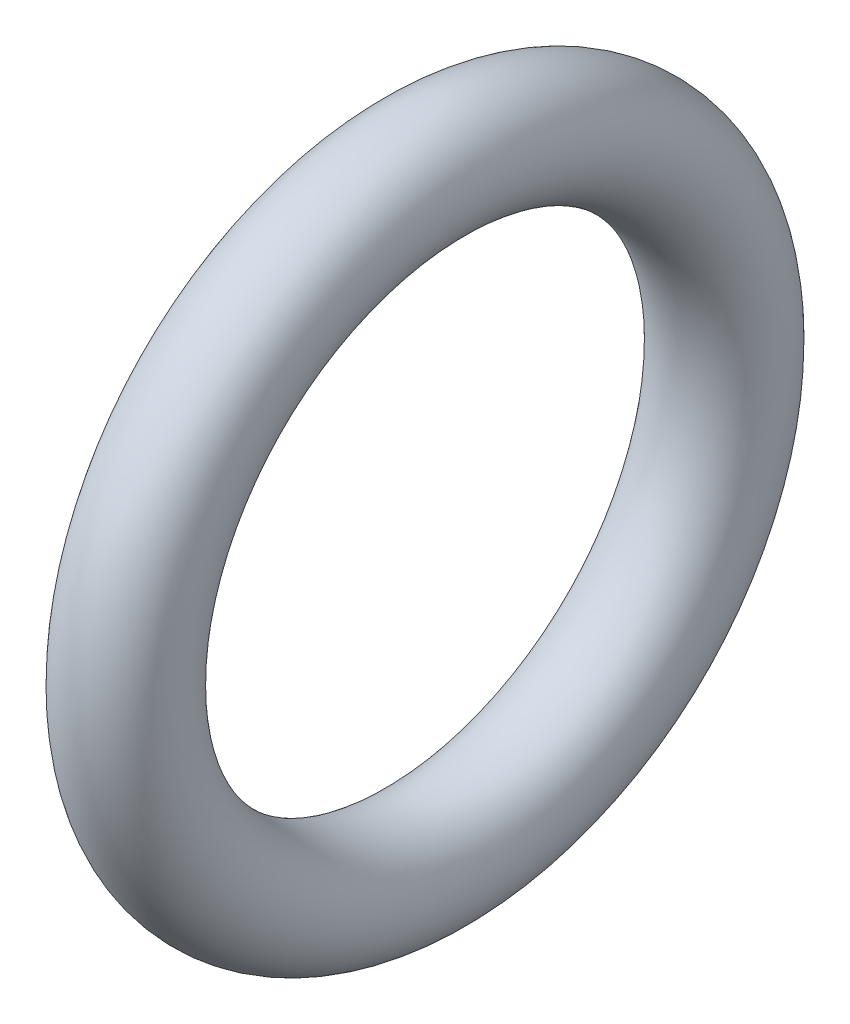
ISO-10303-21;
HEADER;
FILE_DESCRIPTION(('STEP AP214'),'2;1');
FILE_NAME('part.step','',(''),(''),'','','');
FILE_SCHEMA(('AUTOMOTIVE_DESIGN { 1 0 10303 214 1 1 1 1 }'));
ENDSEC;
DATA;
#1=APPLICATION_CONTEXT('core data for automotive mechanical design processes');
#2=APPLICATION_PROTOCOL_DEFINITION('international standard','automotive_design',2000,#1);
#3=PRODUCT_CONTEXT('',#1,'mechanical');
#4=PRODUCT('Part','Part','',(#3));
#5=PRODUCT_RELATED_PRODUCT_CATEGORY('part','',(#4));
#6=PRODUCT_DEFINITION_FORMATION('','',#4);
#7=PRODUCT_DEFINITION_CONTEXT('part definition',#1,'design');
#8=PRODUCT_DEFINITION('design','',#6,#7);
#9=PRODUCT_DEFINITION_SHAPE('','',#8);
#10=(LENGTH_UNIT() NAMED_UNIT(*) SI_UNIT(.MILLI.,.METRE.));
#11=(NAMED_UNIT(*) PLANE_ANGLE_UNIT() SI_UNIT($,.RADIAN.));
#12=(NAMED_UNIT(*) SI_UNIT($,.STERADIAN.) SOLID_ANGLE_UNIT());
#13=UNCERTAINTY_MEASURE_WITH_UNIT(LENGTH_MEASURE(1.E-05),#10,'distance_accuracy_value','');
#14=(GEOMETRIC_REPRESENTATION_CONTEXT(3) GLOBAL_UNCERTAINTY_ASSIGNED_CONTEXT((#13)) GLOBAL_UNIT_ASSIGNED_CONTEXT((#10,
#11,#12)) REPRESENTATION_CONTEXT('',''));
#15=CARTESIAN_POINT('',(0.,0.,0.));
#16=DIRECTION('',(0.,0.,1.));
#17=DIRECTION('',(1.,0.,0.));
#18=AXIS2_PLACEMENT_3D('',#15,#16,#17);
#19=CARTESIAN_POINT('',(0.,0.,0.));
#20=DIRECTION('',(-1.,0.,0.));
#21=DIRECTION('',(0.,0.,1.));
#22=AXIS2_PLACEMENT_3D('',#19,#20,#21);
#23=TOROIDAL_SURFACE('',#22,4.7117,0.889);
#24=CARTESIAN_POINT('',(0.,0.,5.6007));
#25=VERTEX_POINT('',#24);
#26=VERTEX_LOOP('',#25);
#27=FACE_BOUND('',#26,.T.);
#28=ADVANCED_FACE('F24',(#27),#23,.T.);
#29=CLOSED_SHELL('',(#28));
#30=MANIFOLD_SOLID_BREP('B2',#29);
#31=ADVANCED_BREP_SHAPE_REPRESENTATION('',(#18,#30),#14);
#32=SHAPE_DEFINITION_REPRESENTATION(#9,#31);
ENDSEC;
END-ISO-10303-21;
